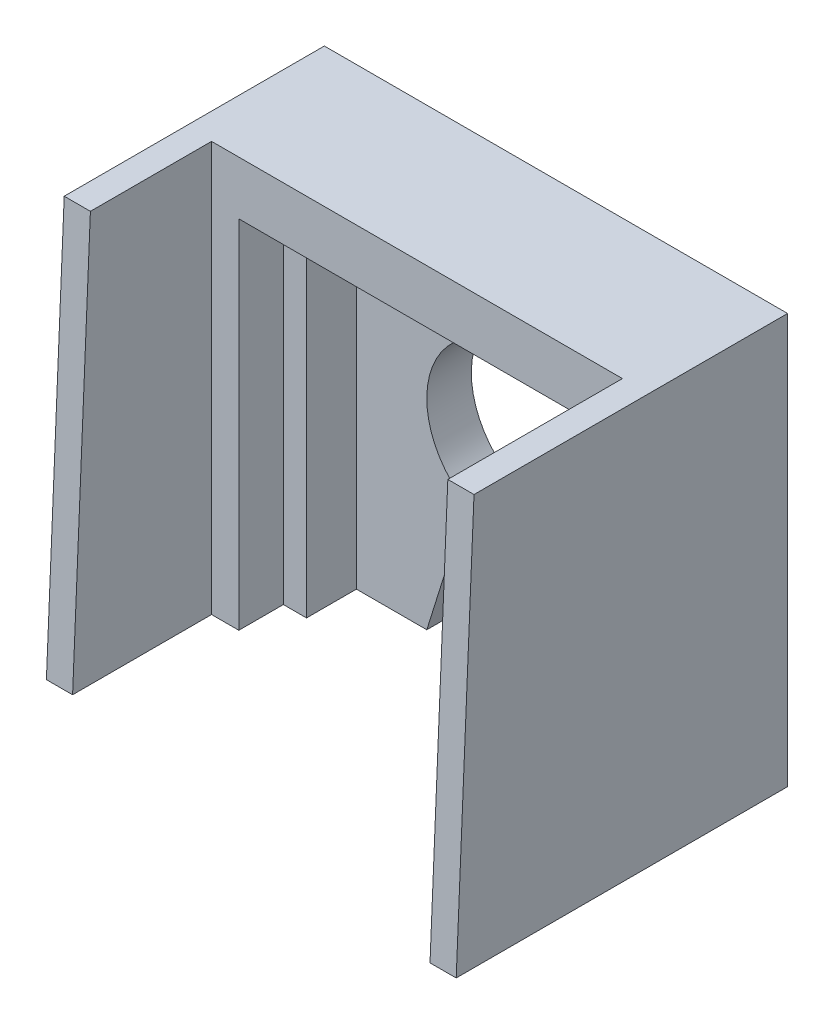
from build123d import *

# Parameters (mm, degrees)
EXTRUDE1_DEPTH     = 2.5
EXTRUDE2_DEPTH     = 7.8
SKETCH3_W          = 1.3
SKETCH3_H          = 20
EXTRUDE3_DEPTH     = 2.8
SKETCH4_W          = 1.47
SKETCH4_H          = 23
EXTRUDE4_DEPTH     = 10.8
CUT_EXTRUDE1_DEPTH = 1.47
CUT_EXTRUDE2_DEPTH = 1.47


with BuildPart() as part:
    # Sketch1 → Extrude1 (new body)
    with BuildSketch(Plane.XY):
        with BuildLine():
            Line((-10, 8.75), (10, 8.75))
            Line((10, 8.75), (10, -11.25))
            Line((10, -11.25), (4.75, -11.25))
            Line((4.75, -11.25), (2.5, -4.038873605))
            ThreePointArc((2.5, -4.038873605), (0, 4.75), (-2.5, -4.038873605))
            Line((-2.5, -4.038873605), (-4.75, -11.25))
            Line((-4.75, -11.25), (-10, -11.25))
            Line((-10, -11.25), (-10, 8.75))
        make_face()
    extrude(amount=EXTRUDE1_DEPTH)

    # Sketch2 → Extrude2 (add)
    with BuildSketch(Plane.XY):
        Polygon((10, -11.25), (10, 8.75), (-10, 8.75), (-10, -11.25), (-13, -11.25), (-13, 11.75), (13, 11.75), (13, -11.25), align=None)
    extrude(amount=EXTRUDE2_DEPTH)

    # Sketch3 → Extrude3 (add)
    with BuildSketch(Plane.XY.offset(2.5)):
        with Locations((-9.35, -1.25)):
            Rectangle(SKETCH3_W, SKETCH3_H)
        with Locations((9.35, -1.25)):
            Rectangle(SKETCH3_W, SKETCH3_H)
    extrude(amount=EXTRUDE3_DEPTH)

    # Sketch4 → Extrude4 (add)
    with BuildSketch(Plane.XY.offset(7.8)):
        with Locations((-12.265, 0.25)):
            Rectangle(SKETCH4_W, SKETCH4_H)
        with Locations((12.265, 0.25)):
            Rectangle(SKETCH4_W, SKETCH4_H)
    extrude(amount=EXTRUDE4_DEPTH)

    # Sketch5 → Cut-Extrude1 (cut)
    with BuildSketch(Plane(origin=(13, 0, 0), x_dir=(0, 0, -1), z_dir=(1, 0, 0))):
        Polygon((-18.6, -11.25), (-18.6, 11.75), (-17.6, 11.75), align=None)
    extrude(amount=-CUT_EXTRUDE1_DEPTH, mode=Mode.SUBTRACT)

    # Sketch6 → Cut-Extrude2 (cut)
    with BuildSketch(Plane.ZY.offset(13)):
        Polygon((18.6, 11.75), (18.6, -11.25), (15.6, -11.25), (14.6, 11.75), align=None)
    extrude(amount=-CUT_EXTRUDE2_DEPTH, mode=Mode.SUBTRACT)


solid = part.part
